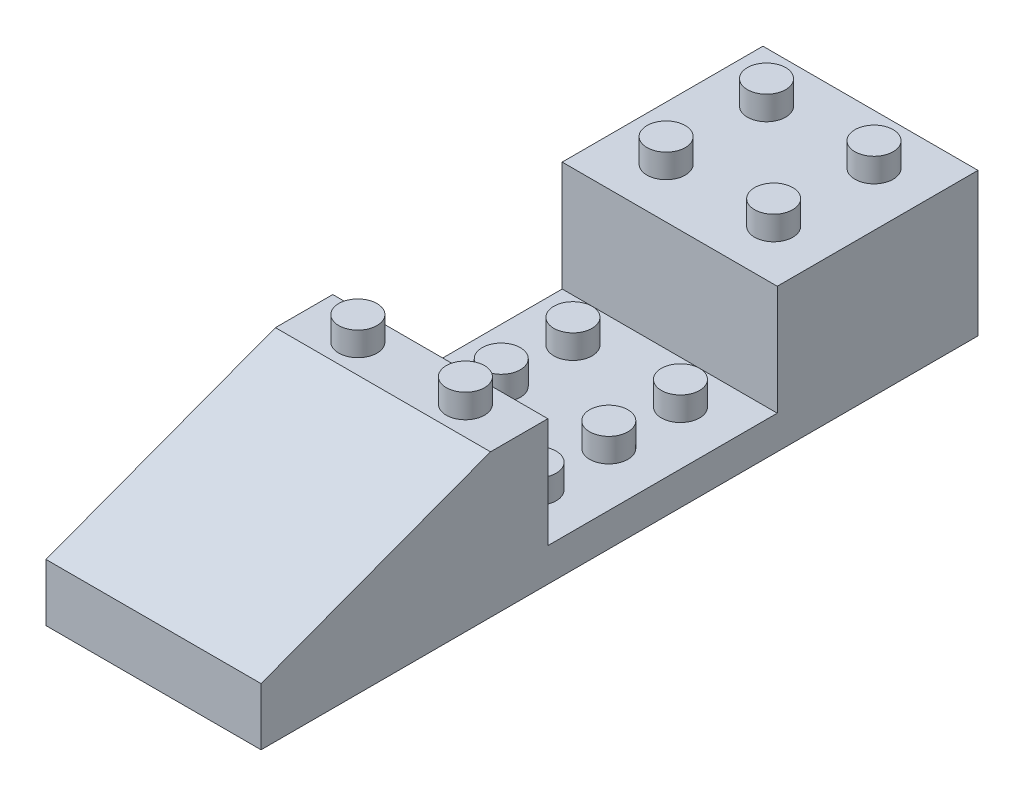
from build123d import *

# Parameters (mm, degrees)
BOSS_EXTRUDE1_DEPTH  = 45
SKETCH2_R            = 4
BOSS_EXTRUDE4_DEPTH  = 5
SKETCH3_R            = 4
BOSS_EXTRUDE5_DEPTH  = 5
SKETCH4_R            = 4
BOSS_EXTRUDE6_DEPTH  = 5
SHELL1_T             = -1
BOSS_EXTRUDE7_START  = 29
SKETCH5_R            = 4
SKETCH5_R_2          = 3
BOSS_EXTRUDE7_DEPTH  = 29
BOSS_EXTRUDE9_START  = 27.5
BOSS_EXTRUDE9_DEPTH  = 27.5
BOSS_EXTRUDE10_START = 6
SKETCH7_R            = 4
SKETCH7_R_2          = 3
BOSS_EXTRUDE10_DEPTH = 6
BOSS_EXTRUDE11_START = 4.5
BOSS_EXTRUDE11_DEPTH = 4.5


with BuildPart() as part:
    # Sketch1 → Boss-Extrude1 (new body)
    with BuildSketch(Plane(origin=(0, 0, 0), x_dir=(0, 0, -1), z_dir=(1, 0, 0))):
        Polygon((0, 0), (150, 0), (150, 30), (108, 30), (108, 7), (60, 7), (60, 30), (48, 30), (0, 12), align=None)
    extrude(amount=-BOSS_EXTRUDE1_DEPTH)

    # Sketch2 → Boss-Extrude4 (add)
    with BuildSketch(Plane(origin=(0, 30, 0), x_dir=(1, 0, 0), z_dir=(0, 1, 0))):
        with Locations(Location((-33.75, 54, 0), (0, 0, 270))):
            Circle(SKETCH2_R)
        with Locations(Location((-11.25, 54, 0), (0, 0, 90))):
            Circle(SKETCH2_R)
    extrude(amount=BOSS_EXTRUDE4_DEPTH)

    # Sketch3 → Boss-Extrude5 (add)
    with BuildSketch(Plane(origin=(0, 30, 0), x_dir=(1, 0, 0), z_dir=(0, 1, 0))):
        with Locations(Location((-33.75, 139.5, 0), (0, 0, 270))):
            Circle(SKETCH3_R)
        with Locations(Location((-33.75, 118.5, 0), (0, 0, 270))):
            Circle(SKETCH3_R)
        with Locations(Location((-11.25, 118.5, 0), (0, 0, 90))):
            Circle(SKETCH3_R)
        with Locations(Location((-11.25, 139.5, 0), (0, 0, 90))):
            Circle(SKETCH3_R)
    extrude(amount=BOSS_EXTRUDE5_DEPTH)

    # Sketch4 → Boss-Extrude6 (add)
    with BuildSketch(Plane(origin=(0, 7, 0), x_dir=(1, 0, 0), z_dir=(0, 1, 0))):
        with Locations(Location((-33.75, 99, 0), (0, 0, 270))):
            Circle(SKETCH4_R)
        with Locations(Location((-33.75, 84, 0), (0, 0, 270))):
            Circle(SKETCH4_R)
        with Locations(Location((-33.75, 69, 0), (0, 0, 270))):
            Circle(SKETCH4_R)
        with Locations(Location((-11.25, 69, 0), (0, 0, 90))):
            Circle(SKETCH4_R)
        with Locations(Location((-11.25, 99, 0), (0, 0, 90))):
            Circle(SKETCH4_R)
        with Locations(Location((-11.25, 84, 0), (0, 0, 90))):
            Circle(SKETCH4_R)
    extrude(amount=BOSS_EXTRUDE6_DEPTH)

    # Shell1
    shell1_openings = [part.faces().sort_by_distance(p)[0] for p in [
        (-22.5, 0, -75),
    ]]
    offset(amount=SHELL1_T, openings=shell1_openings, kind=Kind.INTERSECTION)

    # Sketch5 → Boss-Extrude7 (add)
    # profile 1 of 6: a face of its own
    with BuildSketch(Plane.XZ.offset(-29).offset(BOSS_EXTRUDE7_START)):
        with Locations(Location((-11.25, -54, 0), (0, 0, 270))):
            Circle(SKETCH5_R)
        with Locations(Location((-11.25, -54, 0), (0, 0, 270))):
            Circle(SKETCH5_R_2, mode=Mode.SUBTRACT)
    # profile 2 of 6: a face of its own
    with BuildSketch(Plane.XZ.offset(-29).offset(BOSS_EXTRUDE7_START)):
        with Locations(Location((-33.75, -54, 0), (0, 0, 90))):
            Circle(SKETCH5_R)
        with Locations(Location((-33.75, -54, 0), (0, 0, 270))):
            Circle(SKETCH5_R_2, mode=Mode.SUBTRACT)
    # profile 3 of 6: a face of its own
    with BuildSketch(Plane.XZ.offset(-29).offset(BOSS_EXTRUDE7_START)):
        with Locations(Location((-11.25, -139.5, 0), (0, 0, 270))):
            Circle(SKETCH5_R)
        with Locations(Location((-11.25, -139.5, 0), (0, 0, 270))):
            Circle(SKETCH5_R_2, mode=Mode.SUBTRACT)
    # profile 4 of 6: a face of its own
    with BuildSketch(Plane.XZ.offset(-29).offset(BOSS_EXTRUDE7_START)):
        with Locations(Location((-33.75, -139.5, 0), (0, 0, 90))):
            Circle(SKETCH5_R)
        with Locations(Location((-33.75, -139.5, 0), (0, 0, 270))):
            Circle(SKETCH5_R_2, mode=Mode.SUBTRACT)
    # profile 5 of 6: a face of its own
    with BuildSketch(Plane.XZ.offset(-29).offset(BOSS_EXTRUDE7_START)):
        with Locations(Location((-33.75, -118.5, 0), (0, 0, 90))):
            Circle(SKETCH5_R)
        with Locations(Location((-33.75, -118.5, 0), (0, 0, 270))):
            Circle(SKETCH5_R_2, mode=Mode.SUBTRACT)
    # profile 6 of 6: a face of its own
    with BuildSketch(Plane.XZ.offset(-29).offset(BOSS_EXTRUDE7_START)):
        with Locations(Location((-11.25, -118.5, 0), (0, 0, 270))):
            Circle(SKETCH5_R)
        with Locations(Location((-11.25, -118.5, 0), (0, 0, 270))):
            Circle(SKETCH5_R_2, mode=Mode.SUBTRACT)
    extrude(amount=-BOSS_EXTRUDE7_DEPTH)

    # Sketch6 → Boss-Extrude9 (add)
    with BuildSketch(Plane.XZ.offset(-29).offset(BOSS_EXTRUDE9_START)):
        with BuildLine():
            Line((-29.820941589, -117.75), (-23.25, -117.75))
            Line((-23.25, -117.75), (-23.25, -109))
            Line((-23.25, -109), (-21.75, -109))
            Line((-21.75, -109), (-21.75, -117.75))
            Line((-21.75, -117.75), (-15.179058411, -117.75))
            ThreePointArc((-15.179058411, -117.75), (-15.25, -118.5), (-15.179058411, -119.25))
            Line((-15.179058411, -119.25), (-21.75, -119.25))
            Line((-21.75, -119.25), (-21.75, -138.75))
            Line((-21.75, -138.75), (-15.179058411, -138.75))
            ThreePointArc((-15.179058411, -138.75), (-15.25, -139.5), (-15.179058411, -140.25))
            Line((-15.179058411, -140.25), (-21.75, -140.25))
            Line((-21.75, -140.25), (-21.75, -149))
            Line((-21.75, -149), (-23.25, -149))
            Line((-23.25, -149), (-23.25, -140.25))
            Line((-23.25, -140.25), (-29.820941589, -140.25))
            ThreePointArc((-29.820941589, -140.25), (-29.75, -139.5), (-29.820941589, -138.75))
            Line((-29.820941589, -138.75), (-23.25, -138.75))
            Line((-23.25, -138.75), (-23.25, -119.25))
            Line((-23.25, -119.25), (-29.820941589, -119.25))
            ThreePointArc((-29.820941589, -119.25), (-29.75, -118.5), (-29.820941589, -117.75))
        make_face()
        with BuildLine():
            Line((-44, -117.75), (-37.679058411, -117.75))
            ThreePointArc((-37.679058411, -117.75), (-37.75, -118.5), (-37.679058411, -119.25))
            Line((-37.679058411, -119.25), (-44, -119.25))
            Line((-44, -119.25), (-44, -117.75))
        make_face()
        with BuildLine():
            Line((-7.320941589, -117.75), (-1, -117.75))
            Line((-1, -117.75), (-1, -119.25))
            Line((-1, -119.25), (-7.320941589, -119.25))
            ThreePointArc((-7.320941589, -119.25), (-7.25, -118.5), (-7.320941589, -117.75))
        make_face()
        with BuildLine():
            Line((-1, -140.25), (-1, -138.75))
            Line((-1, -138.75), (-7.320941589, -138.75))
            ThreePointArc((-7.320941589, -138.75), (-7.25, -139.5), (-7.320941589, -140.25))
            Line((-7.320941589, -140.25), (-1, -140.25))
        make_face()
        with BuildLine():
            Line((-44, -140.25), (-44, -138.75))
            Line((-44, -138.75), (-37.679058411, -138.75))
            ThreePointArc((-37.679058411, -138.75), (-37.75, -139.5), (-37.679058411, -140.25))
            Line((-37.679058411, -140.25), (-44, -140.25))
        make_face()
        with BuildLine():
            Line((-44, -52.840667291), (-37.578308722, -52.840667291))
            ThreePointArc((-37.578308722, -52.840667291), (-37.728224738, -53.58319317), (-37.735466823, -54.340667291))
            Line((-37.735466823, -54.340667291), (-44, -54.340667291))
            Line((-44, -54.340667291), (-44, -52.840667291))
        make_face()
        with BuildLine():
            Line((-29.921691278, -52.840667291), (-23.25, -52.840667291))
            Line((-23.25, -52.840667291), (-23.25, -48.181334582))
            Line((-23.25, -48.181334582), (-21.75, -48.181334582))
            Line((-21.75, -48.181334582), (-21.75, -52.840667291))
            Line((-21.75, -52.840667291), (-15.078308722, -52.840667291))
            ThreePointArc((-15.078308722, -52.840667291), (-15.228224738, -53.58319317), (-15.235466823, -54.340667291))
            Line((-15.235466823, -54.340667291), (-21.75, -54.340667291))
            Line((-21.75, -54.340667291), (-21.75, -59))
            Line((-21.75, -59), (-23.25, -59))
            Line((-23.25, -59), (-23.25, -54.340667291))
            Line((-23.25, -54.340667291), (-29.764533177, -54.340667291))
            ThreePointArc((-29.764533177, -54.340667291), (-29.771775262, -53.58319317), (-29.921691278, -52.840667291))
        make_face()
        with BuildLine():
            Line((-7.421691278, -52.840667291), (-1, -52.840667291))
            Line((-1, -52.840667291), (-1, -54.340667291))
            Line((-1, -54.340667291), (-7.264533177, -54.340667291))
            ThreePointArc((-7.264533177, -54.340667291), (-7.271775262, -53.58319317), (-7.421691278, -52.840667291))
        make_face()
    extrude(amount=-BOSS_EXTRUDE9_DEPTH)

    # Sketch7 → Boss-Extrude10 (add)
    # profile 1 of 6: a face of its own
    with BuildSketch(Plane.XZ.offset(-6).offset(BOSS_EXTRUDE10_START)):
        with Locations(Location((-33.75, -69, 0), (0, 0, 90))):
            Circle(SKETCH7_R)
        with Locations(Location((-33.75, -69, 0), (0, 0, 270))):
            Circle(SKETCH7_R_2, mode=Mode.SUBTRACT)
    # profile 2 of 6: a face of its own
    with BuildSketch(Plane.XZ.offset(-6).offset(BOSS_EXTRUDE10_START)):
        with Locations(Location((-11.25, -69, 0), (0, 0, 270))):
            Circle(SKETCH7_R)
        with Locations(Location((-11.25, -69, 0), (0, 0, 270))):
            Circle(SKETCH7_R_2, mode=Mode.SUBTRACT)
    # profile 3 of 6: a face of its own
    with BuildSketch(Plane.XZ.offset(-6).offset(BOSS_EXTRUDE10_START)):
        with Locations(Location((-33.75, -84, 0), (0, 0, 90))):
            Circle(SKETCH7_R)
        with Locations(Location((-33.75, -84, 0), (0, 0, 270))):
            Circle(SKETCH7_R_2, mode=Mode.SUBTRACT)
    # profile 4 of 6: a face of its own
    with BuildSketch(Plane.XZ.offset(-6).offset(BOSS_EXTRUDE10_START)):
        with Locations(Location((-33.75, -99, 0), (0, 0, 90))):
            Circle(SKETCH7_R)
        with Locations(Location((-33.75, -99, 0), (0, 0, 270))):
            Circle(SKETCH7_R_2, mode=Mode.SUBTRACT)
    # profile 5 of 6: a face of its own
    with BuildSketch(Plane.XZ.offset(-6).offset(BOSS_EXTRUDE10_START)):
        with Locations(Location((-11.25, -84, 0), (0, 0, 270))):
            Circle(SKETCH7_R)
        with Locations(Location((-11.25, -84, 0), (0, 0, 270))):
            Circle(SKETCH7_R_2, mode=Mode.SUBTRACT)
    # profile 6 of 6: a face of its own
    with BuildSketch(Plane.XZ.offset(-6).offset(BOSS_EXTRUDE10_START)):
        with Locations(Location((-11.25, -99, 0), (0, 0, 270))):
            Circle(SKETCH7_R)
        with Locations(Location((-11.25, -99, 0), (0, 0, 270))):
            Circle(SKETCH7_R_2, mode=Mode.SUBTRACT)
    extrude(amount=-BOSS_EXTRUDE10_DEPTH)

    # Sketch8 → Boss-Extrude11 (add)
    with BuildSketch(Plane(origin=(0, 6, 0), x_dir=(-1, 0, 0), z_dir=(0, -1, 0)).offset(BOSS_EXTRUDE11_START)):
        with BuildLine():
            Line((21.75, 83.25), (21.75, 69.75))
            Line((21.75, 69.75), (15.179058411, 69.75))
            ThreePointArc((15.179058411, 69.75), (15.23222511, 69.376673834), (15.25, 69))
            ThreePointArc((15.25, 69), (15.23222511, 68.623326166), (15.179058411, 68.25))
            Line((15.179058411, 68.25), (21.75, 68.25))
            Line((21.75, 68.25), (21.75, 59))
            Line((21.75, 59), (23.25, 59))
            Line((23.25, 59), (23.25, 68.25))
            Line((23.25, 68.25), (29.820941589, 68.25))
            ThreePointArc((29.820941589, 68.25), (29.75, 69), (29.820941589, 69.75))
            Line((29.820941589, 69.75), (23.25, 69.75))
            Line((23.25, 69.75), (23.25, 83.25))
            Line((23.25, 83.25), (29.820941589, 83.25))
            ThreePointArc((29.820941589, 83.25), (29.75, 84), (29.820941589, 84.75))
            Line((29.820941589, 84.75), (23.25, 84.75))
            Line((23.25, 84.75), (23.25, 98.25))
            Line((23.25, 98.25), (29.820941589, 98.25))
            ThreePointArc((29.820941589, 98.25), (29.75, 99), (29.820941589, 99.75))
            Line((29.820941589, 99.75), (23.25, 99.75))
            Line((23.25, 99.75), (23.25, 109))
            Line((23.25, 109), (21.75, 109))
            Line((21.75, 109), (21.75, 99.75))
            Line((21.75, 99.75), (15.179058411, 99.75))
            ThreePointArc((15.179058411, 99.75), (15.23222511, 99.376673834), (15.25, 99))
            ThreePointArc((15.25, 99), (15.23222511, 98.623326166), (15.179058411, 98.25))
            Line((15.179058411, 98.25), (21.75, 98.25))
            Line((21.75, 98.25), (21.75, 84.75))
            Line((21.75, 84.75), (15.179058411, 84.75))
            ThreePointArc((15.179058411, 84.75), (15.23222511, 84.376673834), (15.25, 84))
            ThreePointArc((15.25, 84), (15.23222511, 83.623326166), (15.179058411, 83.25))
            Line((15.179058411, 83.25), (21.75, 83.25))
        make_face()
        with BuildLine():
            ThreePointArc((7.320941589, 68.25), (7.25, 69), (7.320941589, 69.75))
            Line((7.320941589, 69.75), (1, 69.75))
            Line((1, 69.75), (1, 68.25))
            Line((1, 68.25), (7.320941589, 68.25))
        make_face()
        with BuildLine():
            Line((1, 83.25), (7.320941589, 83.25))
            ThreePointArc((7.320941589, 83.25), (7.25, 84), (7.320941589, 84.75))
            Line((7.320941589, 84.75), (1, 84.75))
            Line((1, 84.75), (1, 83.25))
        make_face()
        with BuildLine():
            Line((37.679058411, 98.25), (44, 98.25))
            Line((44, 98.25), (44, 99.75))
            Line((44, 99.75), (37.679058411, 99.75))
            ThreePointArc((37.679058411, 99.75), (37.73222511, 99.376673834), (37.75, 99))
            ThreePointArc((37.75, 99), (37.73222511, 98.623326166), (37.679058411, 98.25))
        make_face()
        with BuildLine():
            Line((44, 68.25), (37.679058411, 68.25))
            ThreePointArc((37.679058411, 68.25), (37.75, 69), (37.679058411, 69.75))
            Line((37.679058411, 69.75), (44, 69.75))
            Line((44, 69.75), (44, 68.25))
        make_face()
        with BuildLine():
            Line((44, 84.75), (37.679058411, 84.75))
            ThreePointArc((37.679058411, 84.75), (37.75, 84), (37.679058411, 83.25))
            Line((37.679058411, 83.25), (44, 83.25))
            Line((44, 83.25), (44, 84.75))
        make_face()
        with BuildLine():
            Line((7.320941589, 99.75), (1, 99.75))
            Line((1, 99.75), (1, 98.25))
            Line((1, 98.25), (7.320941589, 98.25))
            ThreePointArc((7.320941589, 98.25), (7.25, 99), (7.320941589, 99.75))
        make_face()
    extrude(amount=-BOSS_EXTRUDE11_DEPTH)


solid = part.part
